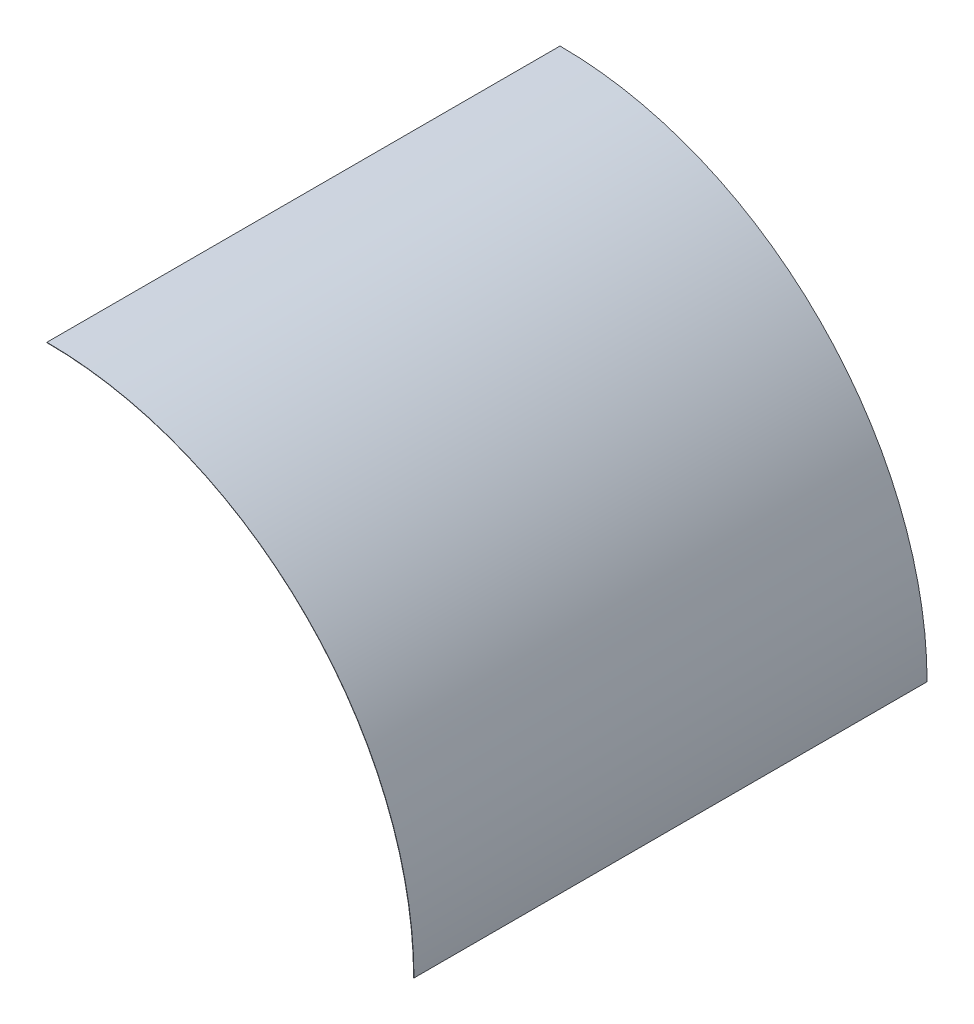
ISO-10303-21;
HEADER;
FILE_DESCRIPTION(('STEP AP214'),'2;1');
FILE_NAME('part.step','',(''),(''),'','','');
FILE_SCHEMA(('AUTOMOTIVE_DESIGN { 1 0 10303 214 1 1 1 1 }'));
ENDSEC;
DATA;
#1=APPLICATION_CONTEXT('core data for automotive mechanical design processes');
#2=APPLICATION_PROTOCOL_DEFINITION('international standard','automotive_design',2000,#1);
#3=PRODUCT_CONTEXT('',#1,'mechanical');
#4=PRODUCT('Part','Part','',(#3));
#5=PRODUCT_RELATED_PRODUCT_CATEGORY('part','',(#4));
#6=PRODUCT_DEFINITION_FORMATION('','',#4);
#7=PRODUCT_DEFINITION_CONTEXT('part definition',#1,'design');
#8=PRODUCT_DEFINITION('design','',#6,#7);
#9=PRODUCT_DEFINITION_SHAPE('','',#8);
#10=(LENGTH_UNIT() NAMED_UNIT(*) SI_UNIT(.MILLI.,.METRE.));
#11=(NAMED_UNIT(*) PLANE_ANGLE_UNIT() SI_UNIT($,.RADIAN.));
#12=(NAMED_UNIT(*) SI_UNIT($,.STERADIAN.) SOLID_ANGLE_UNIT());
#13=UNCERTAINTY_MEASURE_WITH_UNIT(LENGTH_MEASURE(1.E-05),#10,'distance_accuracy_value','');
#14=(GEOMETRIC_REPRESENTATION_CONTEXT(3) GLOBAL_UNCERTAINTY_ASSIGNED_CONTEXT((#13)) GLOBAL_UNIT_ASSIGNED_CONTEXT((#10,
#11,#12)) REPRESENTATION_CONTEXT('',''));
#15=CARTESIAN_POINT('',(0.,0.,0.));
#16=DIRECTION('',(0.,0.,1.));
#17=DIRECTION('',(1.,0.,0.));
#18=AXIS2_PLACEMENT_3D('',#15,#16,#17);
#19=CARTESIAN_POINT('',(0.,0.,-3000.));
#20=DIRECTION('',(0.,0.,1.));
#21=DIRECTION('',(1.,0.,0.));
#22=AXIS2_PLACEMENT_3D('',#19,#20,#21);
#23=CYLINDRICAL_SURFACE('',#22,2144.);
#24=CARTESIAN_POINT('',(0.,0.,0.));
#25=DIRECTION('',(0.,0.,-1.));
#26=DIRECTION('',(-1.,0.,0.));
#27=AXIS2_PLACEMENT_3D('',#24,#25,#26);
#28=CIRCLE('',#27,2144.);
#29=CARTESIAN_POINT('',(0.,2144.,0.));
#30=VERTEX_POINT('',#29);
#31=CARTESIAN_POINT('',(2144.,0.,0.));
#32=VERTEX_POINT('',#31);
#33=EDGE_CURVE('E109',#30,#32,#28,.T.);
#34=ORIENTED_EDGE('',*,*,#33,.F.);
#35=DIRECTION('',(0.,0.,1.));
#36=VECTOR('',#35,1.);
#37=CARTESIAN_POINT('',(0.,2144.,-3000.));
#38=LINE('',#37,#36);
#39=CARTESIAN_POINT('',(0.,2144.,-3000.));
#40=VERTEX_POINT('',#39);
#41=EDGE_CURVE('E11',#40,#30,#38,.T.);
#42=ORIENTED_EDGE('',*,*,#41,.F.);
#43=CARTESIAN_POINT('',(0.,0.,-3000.));
#44=DIRECTION('',(0.,0.,-1.));
#45=DIRECTION('',(-1.,0.,0.));
#46=AXIS2_PLACEMENT_3D('',#43,#44,#45);
#47=CIRCLE('',#46,2144.);
#48=CARTESIAN_POINT('',(2144.,0.,-3000.));
#49=VERTEX_POINT('',#48);
#50=EDGE_CURVE('E101',#40,#49,#47,.T.);
#51=ORIENTED_EDGE('',*,*,#50,.T.);
#52=DIRECTION('',(0.,0.,1.));
#53=VECTOR('',#52,1.);
#54=CARTESIAN_POINT('',(2144.,0.,-3000.));
#55=LINE('',#54,#53);
#56=EDGE_CURVE('E42',#49,#32,#55,.T.);
#57=ORIENTED_EDGE('',*,*,#56,.T.);
#58=EDGE_LOOP('',(#34,#42,#51,#57));
#59=FACE_BOUND('',#58,.T.);
#60=ADVANCED_FACE('F39',(#59),#23,.F.);
#61=CARTESIAN_POINT('',(0.,2146.,-3000.));
#62=DIRECTION('',(-1.,0.,0.));
#63=DIRECTION('',(0.,0.,1.));
#64=AXIS2_PLACEMENT_3D('',#61,#62,#63);
#65=PLANE('',#64);
#66=DIRECTION('',(0.,-1.,0.));
#67=VECTOR('',#66,1.);
#68=CARTESIAN_POINT('',(0.,2146.,0.));
#69=LINE('',#68,#67);
#70=CARTESIAN_POINT('',(0.,2146.,0.));
#71=VERTEX_POINT('',#70);
#72=EDGE_CURVE('E104',#71,#30,#69,.T.);
#73=ORIENTED_EDGE('',*,*,#72,.F.);
#74=DIRECTION('',(0.,0.,1.));
#75=VECTOR('',#74,1.);
#76=CARTESIAN_POINT('',(0.,2146.,-3000.));
#77=LINE('',#76,#75);
#78=CARTESIAN_POINT('',(0.,2146.,-3000.));
#79=VERTEX_POINT('',#78);
#80=EDGE_CURVE('E49',#79,#71,#77,.T.);
#81=ORIENTED_EDGE('',*,*,#80,.F.);
#82=DIRECTION('',(0.,-1.,0.));
#83=VECTOR('',#82,1.);
#84=CARTESIAN_POINT('',(0.,2146.,-3000.));
#85=LINE('',#84,#83);
#86=EDGE_CURVE('E96',#79,#40,#85,.T.);
#87=ORIENTED_EDGE('',*,*,#86,.T.);
#88=ORIENTED_EDGE('',*,*,#41,.T.);
#89=EDGE_LOOP('',(#73,#81,#87,#88));
#90=FACE_BOUND('',#89,.T.);
#91=ADVANCED_FACE('F125',(#90),#65,.T.);
#92=CARTESIAN_POINT('',(0.,0.,-3000.));
#93=DIRECTION('',(0.,0.,1.));
#94=DIRECTION('',(1.,0.,0.));
#95=AXIS2_PLACEMENT_3D('',#92,#93,#94);
#96=CYLINDRICAL_SURFACE('',#95,2146.);
#97=CARTESIAN_POINT('',(0.,0.,0.));
#98=DIRECTION('',(0.,0.,1.));
#99=DIRECTION('',(-1.,0.,0.));
#100=AXIS2_PLACEMENT_3D('',#97,#98,#99);
#101=CIRCLE('',#100,2146.);
#102=CARTESIAN_POINT('',(2146.,2.62809203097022E-13,0.));
#103=VERTEX_POINT('',#102);
#104=EDGE_CURVE('E90',#103,#71,#101,.T.);
#105=ORIENTED_EDGE('',*,*,#104,.F.);
#106=DIRECTION('',(0.,0.,1.));
#107=VECTOR('',#106,1.);
#108=CARTESIAN_POINT('',(2146.,2.62809203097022E-13,-3000.));
#109=LINE('',#108,#107);
#110=CARTESIAN_POINT('',(2146.,2.62809203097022E-13,-3000.));
#111=VERTEX_POINT('',#110);
#112=EDGE_CURVE('E85',#111,#103,#109,.T.);
#113=ORIENTED_EDGE('',*,*,#112,.F.);
#114=CARTESIAN_POINT('',(0.,0.,-3000.));
#115=DIRECTION('',(0.,0.,1.));
#116=DIRECTION('',(-1.,0.,0.));
#117=AXIS2_PLACEMENT_3D('',#114,#115,#116);
#118=CIRCLE('',#117,2146.);
#119=EDGE_CURVE('E88',#111,#79,#118,.T.);
#120=ORIENTED_EDGE('',*,*,#119,.T.);
#121=ORIENTED_EDGE('',*,*,#80,.T.);
#122=EDGE_LOOP('',(#105,#113,#120,#121));
#123=FACE_BOUND('',#122,.T.);
#124=ADVANCED_FACE('F87',(#123),#96,.T.);
#125=CARTESIAN_POINT('',(2146.,0.,-3000.));
#126=DIRECTION('',(0.,-1.,0.));
#127=DIRECTION('',(0.,0.,-1.));
#128=AXIS2_PLACEMENT_3D('',#125,#126,#127);
#129=PLANE('',#128);
#130=DIRECTION('',(1.,0.,0.));
#131=VECTOR('',#130,1.);
#132=CARTESIAN_POINT('',(2146.,0.,0.));
#133=LINE('',#132,#131);
#134=EDGE_CURVE('E113',#32,#103,#133,.T.);
#135=ORIENTED_EDGE('',*,*,#134,.F.);
#136=ORIENTED_EDGE('',*,*,#56,.F.);
#137=DIRECTION('',(1.,0.,0.));
#138=VECTOR('',#137,1.);
#139=CARTESIAN_POINT('',(2146.,0.,-3000.));
#140=LINE('',#139,#138);
#141=EDGE_CURVE('E95',#49,#111,#140,.T.);
#142=ORIENTED_EDGE('',*,*,#141,.T.);
#143=ORIENTED_EDGE('',*,*,#112,.T.);
#144=EDGE_LOOP('',(#135,#136,#142,#143));
#145=FACE_BOUND('',#144,.T.);
#146=ADVANCED_FACE('F99',(#145),#129,.T.);
#147=CARTESIAN_POINT('',(0.,0.,-3000.));
#148=DIRECTION('',(0.,0.,-1.));
#149=DIRECTION('',(-1.,0.,0.));
#150=AXIS2_PLACEMENT_3D('',#147,#148,#149);
#151=PLANE('',#150);
#152=ORIENTED_EDGE('',*,*,#50,.F.);
#153=ORIENTED_EDGE('',*,*,#86,.F.);
#154=ORIENTED_EDGE('',*,*,#119,.F.);
#155=ORIENTED_EDGE('',*,*,#141,.F.);
#156=EDGE_LOOP('',(#152,#153,#154,#155));
#157=FACE_BOUND('',#156,.T.);
#158=ADVANCED_FACE('F94',(#157),#151,.T.);
#159=CARTESIAN_POINT('',(0.,0.,0.));
#160=DIRECTION('',(0.,0.,-1.));
#161=DIRECTION('',(-1.,0.,0.));
#162=AXIS2_PLACEMENT_3D('',#159,#160,#161);
#163=PLANE('',#162);
#164=ORIENTED_EDGE('',*,*,#33,.T.);
#165=ORIENTED_EDGE('',*,*,#134,.T.);
#166=ORIENTED_EDGE('',*,*,#104,.T.);
#167=ORIENTED_EDGE('',*,*,#72,.T.);
#168=EDGE_LOOP('',(#164,#165,#166,#167));
#169=FACE_BOUND('',#168,.T.);
#170=ADVANCED_FACE('F124',(#169),#163,.F.);
#171=CLOSED_SHELL('',(#60,#91,#124,#146,#158,#170));
#172=MANIFOLD_SOLID_BREP('B2',#171);
#173=ADVANCED_BREP_SHAPE_REPRESENTATION('',(#18,#172),#14);
#174=SHAPE_DEFINITION_REPRESENTATION(#9,#173);
ENDSEC;
END-ISO-10303-21;
